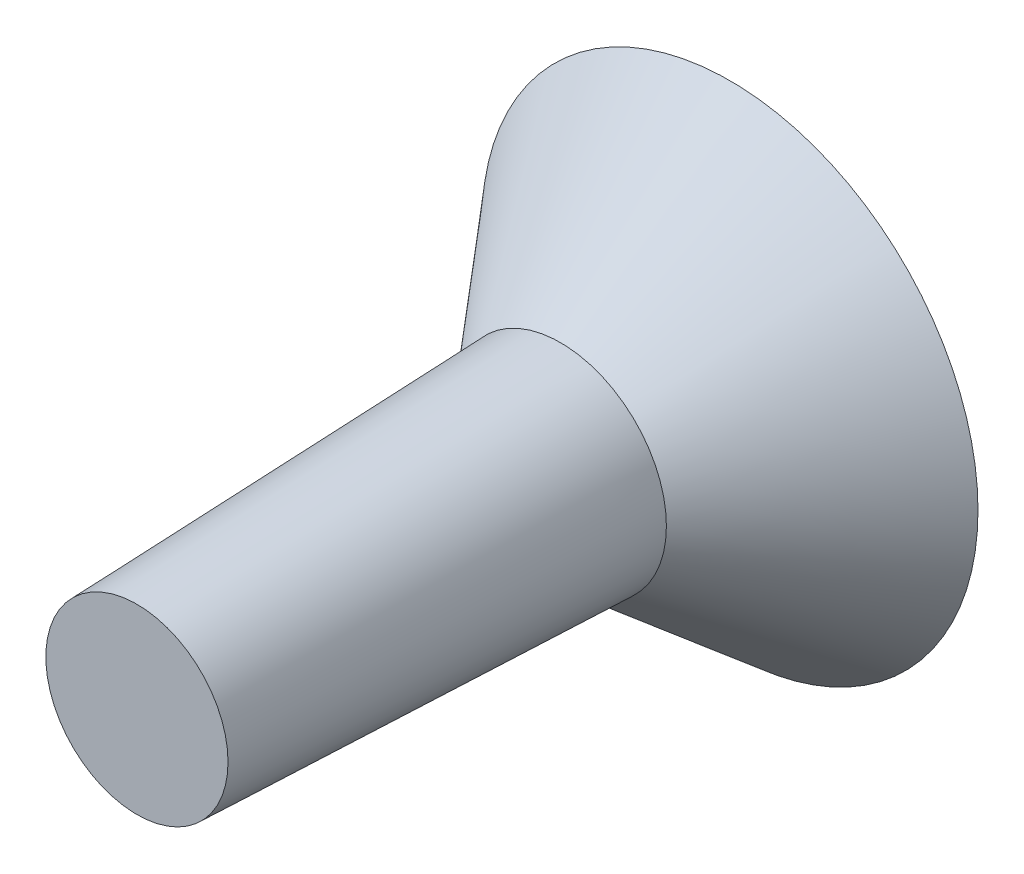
ISO-10303-21;
HEADER;
FILE_DESCRIPTION(('STEP AP214'),'2;1');
FILE_NAME('part.step','',(''),(''),'','','');
FILE_SCHEMA(('AUTOMOTIVE_DESIGN { 1 0 10303 214 1 1 1 1 }'));
ENDSEC;
DATA;
#1=APPLICATION_CONTEXT('core data for automotive mechanical design processes');
#2=APPLICATION_PROTOCOL_DEFINITION('international standard','automotive_design',2000,#1);
#3=PRODUCT_CONTEXT('',#1,'mechanical');
#4=PRODUCT('Part','Part','',(#3));
#5=PRODUCT_RELATED_PRODUCT_CATEGORY('part','',(#4));
#6=PRODUCT_DEFINITION_FORMATION('','',#4);
#7=PRODUCT_DEFINITION_CONTEXT('part definition',#1,'design');
#8=PRODUCT_DEFINITION('design','',#6,#7);
#9=PRODUCT_DEFINITION_SHAPE('','',#8);
#10=(LENGTH_UNIT() NAMED_UNIT(*) SI_UNIT(.MILLI.,.METRE.));
#11=(NAMED_UNIT(*) PLANE_ANGLE_UNIT() SI_UNIT($,.RADIAN.));
#12=(NAMED_UNIT(*) SI_UNIT($,.STERADIAN.) SOLID_ANGLE_UNIT());
#13=UNCERTAINTY_MEASURE_WITH_UNIT(LENGTH_MEASURE(1.E-05),#10,'distance_accuracy_value','');
#14=(GEOMETRIC_REPRESENTATION_CONTEXT(3) GLOBAL_UNCERTAINTY_ASSIGNED_CONTEXT((#13)) GLOBAL_UNIT_ASSIGNED_CONTEXT((#10,
#11,#12)) REPRESENTATION_CONTEXT('',''));
#15=CARTESIAN_POINT('',(0.,0.,0.));
#16=DIRECTION('',(0.,0.,1.));
#17=DIRECTION('',(1.,0.,0.));
#18=AXIS2_PLACEMENT_3D('',#15,#16,#17);
#19=CARTESIAN_POINT('',(-0.375,-1.375,-2.));
#20=DIRECTION('',(0.,0.707106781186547,-0.707106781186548));
#21=DIRECTION('',(0.,0.707106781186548,0.707106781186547));
#22=AXIS2_PLACEMENT_3D('',#19,#20,#21);
#23=PLANE('',#22);
#24=DIRECTION('',(0.,-0.707106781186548,-0.707106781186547));
#25=VECTOR('',#24,1.);
#26=CARTESIAN_POINT('',(-0.375,-1.375,-2.));
#27=LINE('',#26,#25);
#28=CARTESIAN_POINT('',(-0.375,-0.375,-1.));
#29=VERTEX_POINT('',#28);
#30=CARTESIAN_POINT('',(-0.375,-1.375,-2.));
#31=VERTEX_POINT('',#30);
#32=EDGE_CURVE('E167',#29,#31,#27,.T.);
#33=ORIENTED_EDGE('',*,*,#32,.F.);
#34=DIRECTION('',(0.577350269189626,0.577350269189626,0.577350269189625));
#35=VECTOR('',#34,1.);
#36=CARTESIAN_POINT('',(-0.791666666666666,-0.791666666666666,-1.41666666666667));
#37=LINE('',#36,#35);
#38=CARTESIAN_POINT('',(-0.0749999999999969,-0.0749999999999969,-0.7));
#39=VERTEX_POINT('',#38);
#40=EDGE_CURVE('E11',#29,#39,#37,.T.);
#41=ORIENTED_EDGE('',*,*,#40,.T.);
#42=DIRECTION('',(1.,0.,0.));
#43=VECTOR('',#42,1.);
#44=CARTESIAN_POINT('',(-0.375,-0.0749999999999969,-0.7));
#45=LINE('',#44,#43);
#46=CARTESIAN_POINT('',(0.0749999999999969,-0.0749999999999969,-0.7));
#47=VERTEX_POINT('',#46);
#48=EDGE_CURVE('E183',#39,#47,#45,.T.);
#49=ORIENTED_EDGE('',*,*,#48,.T.);
#50=DIRECTION('',(-0.577350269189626,0.577350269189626,0.577350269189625));
#51=VECTOR('',#50,1.);
#52=CARTESIAN_POINT('',(0.791666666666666,-0.791666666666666,-1.41666666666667));
#53=LINE('',#52,#51);
#54=CARTESIAN_POINT('',(0.375,-0.375,-1.));
#55=VERTEX_POINT('',#54);
#56=EDGE_CURVE('E39',#55,#47,#53,.T.);
#57=ORIENTED_EDGE('',*,*,#56,.F.);
#58=DIRECTION('',(0.,-0.707106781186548,-0.707106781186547));
#59=VECTOR('',#58,1.);
#60=CARTESIAN_POINT('',(0.375,-0.725,-1.35));
#61=LINE('',#60,#59);
#62=CARTESIAN_POINT('',(0.375,-1.375,-2.));
#63=VERTEX_POINT('',#62);
#64=EDGE_CURVE('E162',#55,#63,#61,.T.);
#65=ORIENTED_EDGE('',*,*,#64,.T.);
#66=DIRECTION('',(1.,0.,0.));
#67=VECTOR('',#66,1.);
#68=CARTESIAN_POINT('',(-0.375,-1.375,-2.));
#69=LINE('',#68,#67);
#70=EDGE_CURVE('E140',#31,#63,#69,.T.);
#71=ORIENTED_EDGE('',*,*,#70,.F.);
#72=EDGE_LOOP('',(#33,#41,#49,#57,#65,#71));
#73=FACE_BOUND('',#72,.T.);
#74=ADVANCED_FACE('F32',(#73),#23,.T.);
#75=CARTESIAN_POINT('',(-1.375,0.375,-2.));
#76=DIRECTION('',(0.707106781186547,0.,-0.707106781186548));
#77=DIRECTION('',(-0.707106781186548,0.,-0.707106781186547));
#78=AXIS2_PLACEMENT_3D('',#75,#76,#77);
#79=PLANE('',#78);
#80=ORIENTED_EDGE('',*,*,#40,.F.);
#81=DIRECTION('',(-0.707106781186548,0.,-0.707106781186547));
#82=VECTOR('',#81,1.);
#83=CARTESIAN_POINT('',(-0.725,-0.375,-1.35));
#84=LINE('',#83,#82);
#85=CARTESIAN_POINT('',(-1.375,-0.375,-2.));
#86=VERTEX_POINT('',#85);
#87=EDGE_CURVE('E166',#29,#86,#84,.T.);
#88=ORIENTED_EDGE('',*,*,#87,.T.);
#89=DIRECTION('',(0.,-1.,0.));
#90=VECTOR('',#89,1.);
#91=CARTESIAN_POINT('',(-1.375,0.375,-2.));
#92=LINE('',#91,#90);
#93=CARTESIAN_POINT('',(-1.375,0.375,-2.));
#94=VERTEX_POINT('',#93);
#95=EDGE_CURVE('E131',#94,#86,#92,.T.);
#96=ORIENTED_EDGE('',*,*,#95,.F.);
#97=DIRECTION('',(-0.707106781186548,0.,-0.707106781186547));
#98=VECTOR('',#97,1.);
#99=CARTESIAN_POINT('',(-1.375,0.375,-2.));
#100=LINE('',#99,#98);
#101=CARTESIAN_POINT('',(-0.375,0.375,-1.));
#102=VERTEX_POINT('',#101);
#103=EDGE_CURVE('E169',#102,#94,#100,.T.);
#104=ORIENTED_EDGE('',*,*,#103,.F.);
#105=DIRECTION('',(0.577350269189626,-0.577350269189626,0.577350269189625));
#106=VECTOR('',#105,1.);
#107=CARTESIAN_POINT('',(-0.791666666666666,0.791666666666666,-1.41666666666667));
#108=LINE('',#107,#106);
#109=CARTESIAN_POINT('',(-0.0749999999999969,0.0749999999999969,-0.7));
#110=VERTEX_POINT('',#109);
#111=EDGE_CURVE('E46',#102,#110,#108,.T.);
#112=ORIENTED_EDGE('',*,*,#111,.T.);
#113=DIRECTION('',(0.,-1.,0.));
#114=VECTOR('',#113,1.);
#115=CARTESIAN_POINT('',(-0.0749999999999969,0.375,-0.7));
#116=LINE('',#115,#114);
#117=EDGE_CURVE('E188',#110,#39,#116,.T.);
#118=ORIENTED_EDGE('',*,*,#117,.T.);
#119=EDGE_LOOP('',(#80,#88,#96,#104,#112,#118));
#120=FACE_BOUND('',#119,.T.);
#121=ADVANCED_FACE('F218',(#120),#79,.T.);
#122=CARTESIAN_POINT('',(1.375,-0.375,-2.));
#123=DIRECTION('',(-0.707106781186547,0.,-0.707106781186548));
#124=DIRECTION('',(-0.707106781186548,0.,0.707106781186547));
#125=AXIS2_PLACEMENT_3D('',#122,#123,#124);
#126=PLANE('',#125);
#127=DIRECTION('',(0.707106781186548,0.,-0.707106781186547));
#128=VECTOR('',#127,1.);
#129=CARTESIAN_POINT('',(1.375,-0.375,-2.));
#130=LINE('',#129,#128);
#131=CARTESIAN_POINT('',(1.375,-0.375,-2.));
#132=VERTEX_POINT('',#131);
#133=EDGE_CURVE('E163',#55,#132,#130,.T.);
#134=ORIENTED_EDGE('',*,*,#133,.F.);
#135=ORIENTED_EDGE('',*,*,#56,.T.);
#136=DIRECTION('',(0.,1.,0.));
#137=VECTOR('',#136,1.);
#138=CARTESIAN_POINT('',(0.0749999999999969,-0.375,-0.7));
#139=LINE('',#138,#137);
#140=CARTESIAN_POINT('',(0.0749999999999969,0.0749999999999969,-0.7));
#141=VERTEX_POINT('',#140);
#142=EDGE_CURVE('E180',#47,#141,#139,.T.);
#143=ORIENTED_EDGE('',*,*,#142,.T.);
#144=DIRECTION('',(-0.577350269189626,-0.577350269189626,0.577350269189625));
#145=VECTOR('',#144,1.);
#146=CARTESIAN_POINT('',(0.791666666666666,0.791666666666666,-1.41666666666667));
#147=LINE('',#146,#145);
#148=CARTESIAN_POINT('',(0.375,0.375,-1.));
#149=VERTEX_POINT('',#148);
#150=EDGE_CURVE('E178',#149,#141,#147,.T.);
#151=ORIENTED_EDGE('',*,*,#150,.F.);
#152=DIRECTION('',(0.707106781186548,0.,-0.707106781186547));
#153=VECTOR('',#152,1.);
#154=CARTESIAN_POINT('',(0.725,0.375,-1.35));
#155=LINE('',#154,#153);
#156=CARTESIAN_POINT('',(1.375,0.375,-2.));
#157=VERTEX_POINT('',#156);
#158=EDGE_CURVE('E158',#149,#157,#155,.T.);
#159=ORIENTED_EDGE('',*,*,#158,.T.);
#160=DIRECTION('',(0.,1.,0.));
#161=VECTOR('',#160,1.);
#162=CARTESIAN_POINT('',(1.375,-0.375,-2.));
#163=LINE('',#162,#161);
#164=EDGE_CURVE('E149',#132,#157,#163,.T.);
#165=ORIENTED_EDGE('',*,*,#164,.F.);
#166=EDGE_LOOP('',(#134,#135,#143,#151,#159,#165));
#167=FACE_BOUND('',#166,.T.);
#168=ADVANCED_FACE('F199',(#167),#126,.T.);
#169=CARTESIAN_POINT('',(0.375,1.375,-2.));
#170=DIRECTION('',(0.,-0.707106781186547,-0.707106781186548));
#171=DIRECTION('',(0.,0.707106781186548,-0.707106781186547));
#172=AXIS2_PLACEMENT_3D('',#169,#170,#171);
#173=PLANE('',#172);
#174=ORIENTED_EDGE('',*,*,#111,.F.);
#175=DIRECTION('',(0.,0.707106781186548,-0.707106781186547));
#176=VECTOR('',#175,1.);
#177=CARTESIAN_POINT('',(-0.375,0.725,-1.35));
#178=LINE('',#177,#176);
#179=CARTESIAN_POINT('',(-0.375,1.375,-2.));
#180=VERTEX_POINT('',#179);
#181=EDGE_CURVE('E109',#102,#180,#178,.T.);
#182=ORIENTED_EDGE('',*,*,#181,.T.);
#183=DIRECTION('',(-1.,0.,0.));
#184=VECTOR('',#183,1.);
#185=CARTESIAN_POINT('',(0.375,1.375,-2.));
#186=LINE('',#185,#184);
#187=CARTESIAN_POINT('',(0.375,1.375,-2.));
#188=VERTEX_POINT('',#187);
#189=EDGE_CURVE('E116',#188,#180,#186,.T.);
#190=ORIENTED_EDGE('',*,*,#189,.F.);
#191=DIRECTION('',(0.,0.707106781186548,-0.707106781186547));
#192=VECTOR('',#191,1.);
#193=CARTESIAN_POINT('',(0.375,0.725,-1.35));
#194=LINE('',#193,#192);
#195=EDGE_CURVE('E159',#149,#188,#194,.T.);
#196=ORIENTED_EDGE('',*,*,#195,.F.);
#197=ORIENTED_EDGE('',*,*,#150,.T.);
#198=DIRECTION('',(-1.,0.,0.));
#199=VECTOR('',#198,1.);
#200=CARTESIAN_POINT('',(0.375,0.0749999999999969,-0.7));
#201=LINE('',#200,#199);
#202=EDGE_CURVE('E155',#141,#110,#201,.T.);
#203=ORIENTED_EDGE('',*,*,#202,.T.);
#204=EDGE_LOOP('',(#174,#182,#190,#196,#197,#203));
#205=FACE_BOUND('',#204,.T.);
#206=ADVANCED_FACE('F119',(#205),#173,.T.);
#207=CARTESIAN_POINT('',(0.,0.,-2.));
#208=DIRECTION('',(0.,0.,-1.));
#209=DIRECTION('',(-1.,0.,0.));
#210=AXIS2_PLACEMENT_3D('',#207,#208,#209);
#211=PLANE('',#210);
#212=CARTESIAN_POINT('',(0.,0.,-2.));
#213=DIRECTION('',(0.,0.,-1.));
#214=DIRECTION('',(-1.,0.,0.));
#215=AXIS2_PLACEMENT_3D('',#212,#213,#214);
#216=CIRCLE('',#215,2.92819926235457);
#217=CARTESIAN_POINT('',(-2.92819926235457,0.,-2.));
#218=VERTEX_POINT('',#217);
#219=EDGE_CURVE('E172',#218,#218,#216,.T.);
#220=ORIENTED_EDGE('',*,*,#219,.T.);
#221=EDGE_LOOP('',(#220));
#222=FACE_BOUND('',#221,.T.);
#223=DIRECTION('',(0.,-1.,0.));
#224=VECTOR('',#223,1.);
#225=CARTESIAN_POINT('',(0.375,1.375,-2.));
#226=LINE('',#225,#224);
#227=CARTESIAN_POINT('',(0.375,0.375,-2.));
#228=VERTEX_POINT('',#227);
#229=EDGE_CURVE('E127',#188,#228,#226,.T.);
#230=ORIENTED_EDGE('',*,*,#229,.F.);
#231=ORIENTED_EDGE('',*,*,#189,.T.);
#232=DIRECTION('',(0.,-1.,0.));
#233=VECTOR('',#232,1.);
#234=CARTESIAN_POINT('',(-0.375,1.375,-2.));
#235=LINE('',#234,#233);
#236=CARTESIAN_POINT('',(-0.375,0.375,-2.));
#237=VERTEX_POINT('',#236);
#238=EDGE_CURVE('E107',#180,#237,#235,.T.);
#239=ORIENTED_EDGE('',*,*,#238,.T.);
#240=DIRECTION('',(-1.,0.,0.));
#241=VECTOR('',#240,1.);
#242=CARTESIAN_POINT('',(-0.375,0.375,-2.));
#243=LINE('',#242,#241);
#244=EDGE_CURVE('E115',#237,#94,#243,.T.);
#245=ORIENTED_EDGE('',*,*,#244,.T.);
#246=ORIENTED_EDGE('',*,*,#95,.T.);
#247=DIRECTION('',(1.,0.,0.));
#248=VECTOR('',#247,1.);
#249=CARTESIAN_POINT('',(-1.375,-0.375,-2.));
#250=LINE('',#249,#248);
#251=CARTESIAN_POINT('',(-0.375,-0.375,-2.));
#252=VERTEX_POINT('',#251);
#253=EDGE_CURVE('E134',#86,#252,#250,.T.);
#254=ORIENTED_EDGE('',*,*,#253,.T.);
#255=DIRECTION('',(0.,-1.,0.));
#256=VECTOR('',#255,1.);
#257=CARTESIAN_POINT('',(-0.375,-0.375,-2.));
#258=LINE('',#257,#256);
#259=EDGE_CURVE('E137',#252,#31,#258,.T.);
#260=ORIENTED_EDGE('',*,*,#259,.T.);
#261=ORIENTED_EDGE('',*,*,#70,.T.);
#262=DIRECTION('',(0.,1.,0.));
#263=VECTOR('',#262,1.);
#264=CARTESIAN_POINT('',(0.375,-1.375,-2.));
#265=LINE('',#264,#263);
#266=CARTESIAN_POINT('',(0.375,-0.375,-2.));
#267=VERTEX_POINT('',#266);
#268=EDGE_CURVE('E143',#63,#267,#265,.T.);
#269=ORIENTED_EDGE('',*,*,#268,.T.);
#270=DIRECTION('',(1.,0.,0.));
#271=VECTOR('',#270,1.);
#272=CARTESIAN_POINT('',(0.375,-0.375,-2.));
#273=LINE('',#272,#271);
#274=EDGE_CURVE('E146',#267,#132,#273,.T.);
#275=ORIENTED_EDGE('',*,*,#274,.T.);
#276=ORIENTED_EDGE('',*,*,#164,.T.);
#277=DIRECTION('',(-1.,0.,0.));
#278=VECTOR('',#277,1.);
#279=CARTESIAN_POINT('',(1.375,0.375,-2.));
#280=LINE('',#279,#278);
#281=EDGE_CURVE('E152',#157,#228,#280,.T.);
#282=ORIENTED_EDGE('',*,*,#281,.T.);
#283=EDGE_LOOP('',(#230,#231,#239,#245,#246,#254,#260,#261,#269,#275,#276,#282));
#284=FACE_BOUND('',#283,.T.);
#285=ADVANCED_FACE('F124',(#222,#284),#211,.T.);
#286=CARTESIAN_POINT('',(0.,0.,0.));
#287=DIRECTION('',(0.,0.,-1.));
#288=DIRECTION('',(1.,0.,0.));
#289=AXIS2_PLACEMENT_3D('',#286,#287,#288);
#290=CONICAL_SURFACE('',#289,1.25,0.0349065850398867);
#291=CARTESIAN_POINT('',(0.,0.,5.));
#292=DIRECTION('',(0.,0.,1.));
#293=DIRECTION('',(1.,0.,0.));
#294=AXIS2_PLACEMENT_3D('',#291,#292,#293);
#295=CIRCLE('',#294,1.07539615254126);
#296=CARTESIAN_POINT('',(1.07539615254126,0.,5.));
#297=VERTEX_POINT('',#296);
#298=EDGE_CURVE('E175',#297,#297,#295,.T.);
#299=ORIENTED_EDGE('',*,*,#298,.F.);
#300=EDGE_LOOP('',(#299));
#301=FACE_BOUND('',#300,.T.);
#302=CARTESIAN_POINT('',(0.,0.,0.));
#303=DIRECTION('',(0.,0.,-1.));
#304=DIRECTION('',(-1.,0.,0.));
#305=AXIS2_PLACEMENT_3D('',#302,#303,#304);
#306=CIRCLE('',#305,1.25);
#307=CARTESIAN_POINT('',(-1.25,0.,0.));
#308=VERTEX_POINT('',#307);
#309=EDGE_CURVE('E122',#308,#308,#306,.T.);
#310=ORIENTED_EDGE('',*,*,#309,.F.);
#311=EDGE_LOOP('',(#310));
#312=FACE_BOUND('',#311,.T.);
#313=ADVANCED_FACE('F243',(#301,#312),#290,.T.);
#314=CARTESIAN_POINT('',(0.,0.,5.));
#315=DIRECTION('',(0.,0.,1.));
#316=DIRECTION('',(1.,0.,0.));
#317=AXIS2_PLACEMENT_3D('',#314,#315,#316);
#318=PLANE('',#317);
#319=ORIENTED_EDGE('',*,*,#298,.T.);
#320=EDGE_LOOP('',(#319));
#321=FACE_BOUND('',#320,.T.);
#322=ADVANCED_FACE('F246',(#321),#318,.T.);
#323=CARTESIAN_POINT('',(0.,0.,0.));
#324=DIRECTION('',(0.,0.,-1.));
#325=DIRECTION('',(-1.,0.,0.));
#326=AXIS2_PLACEMENT_3D('',#323,#324,#325);
#327=CONICAL_SURFACE('',#326,1.25,0.698131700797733);
#328=ORIENTED_EDGE('',*,*,#219,.F.);
#329=EDGE_LOOP('',(#328));
#330=FACE_BOUND('',#329,.T.);
#331=ORIENTED_EDGE('',*,*,#309,.T.);
#332=EDGE_LOOP('',(#331));
#333=FACE_BOUND('',#332,.T.);
#334=ADVANCED_FACE('F230',(#330,#333),#327,.T.);
#335=CARTESIAN_POINT('',(-0.375,1.375,-0.7));
#336=DIRECTION('',(1.,0.,0.));
#337=DIRECTION('',(0.,1.,0.));
#338=AXIS2_PLACEMENT_3D('',#335,#336,#337);
#339=PLANE('',#338);
#340=ORIENTED_EDGE('',*,*,#238,.F.);
#341=ORIENTED_EDGE('',*,*,#181,.F.);
#342=DIRECTION('',(0.,0.,-1.));
#343=VECTOR('',#342,1.);
#344=CARTESIAN_POINT('',(-0.375,0.375,-0.7));
#345=LINE('',#344,#343);
#346=EDGE_CURVE('E110',#102,#237,#345,.T.);
#347=ORIENTED_EDGE('',*,*,#346,.T.);
#348=EDGE_LOOP('',(#340,#341,#347));
#349=FACE_BOUND('',#348,.T.);
#350=ADVANCED_FACE('F108',(#349),#339,.T.);
#351=CARTESIAN_POINT('',(-0.375,0.375,-0.7));
#352=DIRECTION('',(0.,-1.,0.));
#353=DIRECTION('',(1.,0.,0.));
#354=AXIS2_PLACEMENT_3D('',#351,#352,#353);
#355=PLANE('',#354);
#356=ORIENTED_EDGE('',*,*,#244,.F.);
#357=ORIENTED_EDGE('',*,*,#346,.F.);
#358=ORIENTED_EDGE('',*,*,#103,.T.);
#359=EDGE_LOOP('',(#356,#357,#358));
#360=FACE_BOUND('',#359,.T.);
#361=ADVANCED_FACE('F221',(#360),#355,.T.);
#362=CARTESIAN_POINT('',(-1.375,-0.375,-0.7));
#363=DIRECTION('',(0.,1.,0.));
#364=DIRECTION('',(-1.,0.,0.));
#365=AXIS2_PLACEMENT_3D('',#362,#363,#364);
#366=PLANE('',#365);
#367=ORIENTED_EDGE('',*,*,#253,.F.);
#368=ORIENTED_EDGE('',*,*,#87,.F.);
#369=DIRECTION('',(0.,0.,-1.));
#370=VECTOR('',#369,1.);
#371=CARTESIAN_POINT('',(-0.375,-0.375,-0.7));
#372=LINE('',#371,#370);
#373=EDGE_CURVE('E164',#29,#252,#372,.T.);
#374=ORIENTED_EDGE('',*,*,#373,.T.);
#375=EDGE_LOOP('',(#367,#368,#374));
#376=FACE_BOUND('',#375,.T.);
#377=ADVANCED_FACE('F216',(#376),#366,.T.);
#378=CARTESIAN_POINT('',(-0.375,-0.375,-0.7));
#379=DIRECTION('',(1.,0.,0.));
#380=DIRECTION('',(0.,1.,0.));
#381=AXIS2_PLACEMENT_3D('',#378,#379,#380);
#382=PLANE('',#381);
#383=ORIENTED_EDGE('',*,*,#259,.F.);
#384=ORIENTED_EDGE('',*,*,#373,.F.);
#385=ORIENTED_EDGE('',*,*,#32,.T.);
#386=EDGE_LOOP('',(#383,#384,#385));
#387=FACE_BOUND('',#386,.T.);
#388=ADVANCED_FACE('F228',(#387),#382,.T.);
#389=CARTESIAN_POINT('',(0.375,-1.375,-0.7));
#390=DIRECTION('',(-1.,0.,0.));
#391=DIRECTION('',(0.,0.,1.));
#392=AXIS2_PLACEMENT_3D('',#389,#390,#391);
#393=PLANE('',#392);
#394=ORIENTED_EDGE('',*,*,#268,.F.);
#395=ORIENTED_EDGE('',*,*,#64,.F.);
#396=DIRECTION('',(0.,0.,-1.));
#397=VECTOR('',#396,1.);
#398=CARTESIAN_POINT('',(0.375,-0.375,-0.7));
#399=LINE('',#398,#397);
#400=EDGE_CURVE('E160',#55,#267,#399,.T.);
#401=ORIENTED_EDGE('',*,*,#400,.T.);
#402=EDGE_LOOP('',(#394,#395,#401));
#403=FACE_BOUND('',#402,.T.);
#404=ADVANCED_FACE('F299',(#403),#393,.T.);
#405=CARTESIAN_POINT('',(0.375,-0.375,-0.7));
#406=DIRECTION('',(0.,1.,0.));
#407=DIRECTION('',(0.,0.,1.));
#408=AXIS2_PLACEMENT_3D('',#405,#406,#407);
#409=PLANE('',#408);
#410=ORIENTED_EDGE('',*,*,#274,.F.);
#411=ORIENTED_EDGE('',*,*,#400,.F.);
#412=ORIENTED_EDGE('',*,*,#133,.T.);
#413=EDGE_LOOP('',(#410,#411,#412));
#414=FACE_BOUND('',#413,.T.);
#415=ADVANCED_FACE('F308',(#414),#409,.T.);
#416=CARTESIAN_POINT('',(1.375,0.375,-0.7));
#417=DIRECTION('',(0.,-1.,0.));
#418=DIRECTION('',(0.,0.,-1.));
#419=AXIS2_PLACEMENT_3D('',#416,#417,#418);
#420=PLANE('',#419);
#421=ORIENTED_EDGE('',*,*,#281,.F.);
#422=ORIENTED_EDGE('',*,*,#158,.F.);
#423=DIRECTION('',(0.,0.,-1.));
#424=VECTOR('',#423,1.);
#425=CARTESIAN_POINT('',(0.375,0.375,-0.7));
#426=LINE('',#425,#424);
#427=EDGE_CURVE('E156',#149,#228,#426,.T.);
#428=ORIENTED_EDGE('',*,*,#427,.T.);
#429=EDGE_LOOP('',(#421,#422,#428));
#430=FACE_BOUND('',#429,.T.);
#431=ADVANCED_FACE('F318',(#430),#420,.T.);
#432=CARTESIAN_POINT('',(0.375,1.375,-0.7));
#433=DIRECTION('',(1.,0.,0.));
#434=DIRECTION('',(0.,1.,0.));
#435=AXIS2_PLACEMENT_3D('',#432,#433,#434);
#436=PLANE('',#435);
#437=ORIENTED_EDGE('',*,*,#229,.T.);
#438=ORIENTED_EDGE('',*,*,#427,.F.);
#439=ORIENTED_EDGE('',*,*,#195,.T.);
#440=EDGE_LOOP('',(#437,#438,#439));
#441=FACE_BOUND('',#440,.T.);
#442=ADVANCED_FACE('F328',(#441),#436,.F.);
#443=CARTESIAN_POINT('',(-1.375,1.375,-0.7));
#444=DIRECTION('',(0.,0.,1.));
#445=DIRECTION('',(1.,0.,0.));
#446=AXIS2_PLACEMENT_3D('',#443,#444,#445);
#447=PLANE('',#446);
#448=ORIENTED_EDGE('',*,*,#117,.F.);
#449=ORIENTED_EDGE('',*,*,#202,.F.);
#450=ORIENTED_EDGE('',*,*,#142,.F.);
#451=ORIENTED_EDGE('',*,*,#48,.F.);
#452=EDGE_LOOP('',(#448,#449,#450,#451));
#453=FACE_BOUND('',#452,.T.);
#454=ADVANCED_FACE('F208',(#453),#447,.F.);
#455=CLOSED_SHELL('',(#74,#121,#168,#206,#285,#313,#322,#334,#350,#361,#377,#388,#404,#415,#431,
#442,#454));
#456=MANIFOLD_SOLID_BREP('B2',#455);
#457=ADVANCED_BREP_SHAPE_REPRESENTATION('',(#18,#456),#14);
#458=SHAPE_DEFINITION_REPRESENTATION(#9,#457);
ENDSEC;
END-ISO-10303-21;
